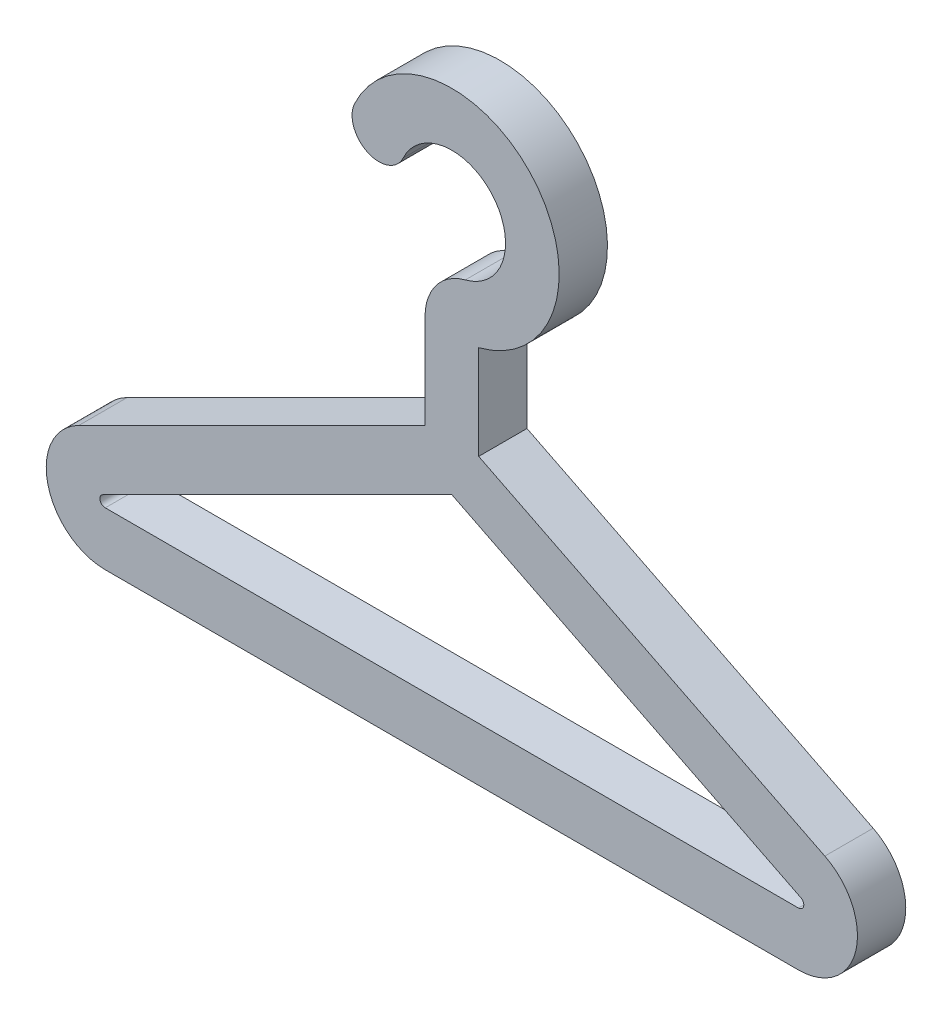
ISO-10303-21;
HEADER;
FILE_DESCRIPTION(('STEP AP214'),'2;1');
FILE_NAME('part.step','',(''),(''),'','','');
FILE_SCHEMA(('AUTOMOTIVE_DESIGN { 1 0 10303 214 1 1 1 1 }'));
ENDSEC;
DATA;
#1=APPLICATION_CONTEXT('core data for automotive mechanical design processes');
#2=APPLICATION_PROTOCOL_DEFINITION('international standard','automotive_design',2000,#1);
#3=PRODUCT_CONTEXT('',#1,'mechanical');
#4=PRODUCT('Part','Part','',(#3));
#5=PRODUCT_RELATED_PRODUCT_CATEGORY('part','',(#4));
#6=PRODUCT_DEFINITION_FORMATION('','',#4);
#7=PRODUCT_DEFINITION_CONTEXT('part definition',#1,'design');
#8=PRODUCT_DEFINITION('design','',#6,#7);
#9=PRODUCT_DEFINITION_SHAPE('','',#8);
#10=(LENGTH_UNIT() NAMED_UNIT(*) SI_UNIT(.MILLI.,.METRE.));
#11=(NAMED_UNIT(*) PLANE_ANGLE_UNIT() SI_UNIT($,.RADIAN.));
#12=(NAMED_UNIT(*) SI_UNIT($,.STERADIAN.) SOLID_ANGLE_UNIT());
#13=UNCERTAINTY_MEASURE_WITH_UNIT(LENGTH_MEASURE(1.E-05),#10,'distance_accuracy_value','');
#14=(GEOMETRIC_REPRESENTATION_CONTEXT(3) GLOBAL_UNCERTAINTY_ASSIGNED_CONTEXT((#13)) GLOBAL_UNIT_ASSIGNED_CONTEXT((#10,
#11,#12)) REPRESENTATION_CONTEXT('',''));
#15=CARTESIAN_POINT('',(0.,0.,0.));
#16=DIRECTION('',(0.,0.,1.));
#17=DIRECTION('',(1.,0.,0.));
#18=AXIS2_PLACEMENT_3D('',#15,#16,#17);
#19=CARTESIAN_POINT('',(329.177708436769,-76.8932928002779,-25.5));
#20=DIRECTION('',(0.,0.,-1.));
#21=DIRECTION('',(-1.,0.,0.));
#22=AXIS2_PLACEMENT_3D('',#19,#20,#21);
#23=CYLINDRICAL_SURFACE('',#22,1.00000000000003);
#24=CARTESIAN_POINT('',(329.177708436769,-76.8932928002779,-34.5));
#25=DIRECTION('',(0.,0.,1.));
#26=DIRECTION('',(1.,0.,0.));
#27=AXIS2_PLACEMENT_3D('',#24,#25,#26);
#28=CIRCLE('',#27,1.00000000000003);
#29=CARTESIAN_POINT('',(329.177708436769,-77.8932928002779,-34.5));
#30=VERTEX_POINT('',#29);
#31=CARTESIAN_POINT('',(329.624922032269,-75.9988656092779,-34.5));
#32=VERTEX_POINT('',#31);
#33=EDGE_CURVE('E212',#30,#32,#28,.T.);
#34=ORIENTED_EDGE('',*,*,#33,.F.);
#35=DIRECTION('',(0.,0.,-1.));
#36=VECTOR('',#35,1.);
#37=CARTESIAN_POINT('',(329.177708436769,-77.8932928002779,-25.5));
#38=LINE('',#37,#36);
#39=CARTESIAN_POINT('',(329.177708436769,-77.8932928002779,-25.5));
#40=VERTEX_POINT('',#39);
#41=EDGE_CURVE('E11',#40,#30,#38,.T.);
#42=ORIENTED_EDGE('',*,*,#41,.F.);
#43=CARTESIAN_POINT('',(329.177708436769,-76.8932928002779,-25.5));
#44=DIRECTION('',(0.,0.,1.));
#45=DIRECTION('',(1.,0.,0.));
#46=AXIS2_PLACEMENT_3D('',#43,#44,#45);
#47=CIRCLE('',#46,1.00000000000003);
#48=CARTESIAN_POINT('',(329.624922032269,-75.9988656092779,-25.5));
#49=VERTEX_POINT('',#48);
#50=EDGE_CURVE('E324',#40,#49,#47,.T.);
#51=ORIENTED_EDGE('',*,*,#50,.T.);
#52=DIRECTION('',(0.,0.,-1.));
#53=VECTOR('',#52,1.);
#54=CARTESIAN_POINT('',(329.624922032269,-75.9988656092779,-25.5));
#55=LINE('',#54,#53);
#56=EDGE_CURVE('E55',#49,#32,#55,.T.);
#57=ORIENTED_EDGE('',*,*,#56,.T.);
#58=EDGE_LOOP('',(#34,#42,#51,#57));
#59=FACE_BOUND('',#58,.T.);
#60=ADVANCED_FACE('F36',(#59),#23,.F.);
#61=CARTESIAN_POINT('',(0.,-77.8932928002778,-25.5));
#62=DIRECTION('',(0.,1.,0.));
#63=DIRECTION('',(-1.,0.,0.));
#64=AXIS2_PLACEMENT_3D('',#61,#62,#63);
#65=PLANE('',#64);
#66=DIRECTION('',(1.,0.,0.));
#67=VECTOR('',#66,1.);
#68=CARTESIAN_POINT('',(0.,-77.8932928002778,-34.5));
#69=LINE('',#68,#67);
#70=CARTESIAN_POINT('',(200.010524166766,-77.8932928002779,-34.5));
#71=VERTEX_POINT('',#70);
#72=EDGE_CURVE('E214',#71,#30,#69,.T.);
#73=ORIENTED_EDGE('',*,*,#72,.F.);
#74=DIRECTION('',(0.,0.,-1.));
#75=VECTOR('',#74,1.);
#76=CARTESIAN_POINT('',(200.010524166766,-77.8932928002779,-25.5));
#77=LINE('',#76,#75);
#78=CARTESIAN_POINT('',(200.010524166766,-77.8932928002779,-25.5));
#79=VERTEX_POINT('',#78);
#80=EDGE_CURVE('E46',#79,#71,#77,.T.);
#81=ORIENTED_EDGE('',*,*,#80,.F.);
#82=DIRECTION('',(1.,0.,0.));
#83=VECTOR('',#82,1.);
#84=CARTESIAN_POINT('',(0.,-77.8932928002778,-25.5));
#85=LINE('',#84,#83);
#86=EDGE_CURVE('E175',#79,#40,#85,.T.);
#87=ORIENTED_EDGE('',*,*,#86,.T.);
#88=ORIENTED_EDGE('',*,*,#41,.T.);
#89=EDGE_LOOP('',(#73,#81,#87,#88));
#90=FACE_BOUND('',#89,.T.);
#91=ADVANCED_FACE('F327',(#90),#65,.T.);
#92=CARTESIAN_POINT('',(200.010524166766,-76.8932928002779,-25.5));
#93=DIRECTION('',(0.,0.,-1.));
#94=DIRECTION('',(-1.,0.,0.));
#95=AXIS2_PLACEMENT_3D('',#92,#93,#94);
#96=CYLINDRICAL_SURFACE('',#95,0.999999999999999);
#97=CARTESIAN_POINT('',(200.010524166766,-76.8932928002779,-34.5));
#98=DIRECTION('',(0.,0.,1.));
#99=DIRECTION('',(1.,0.,0.));
#100=AXIS2_PLACEMENT_3D('',#97,#98,#99);
#101=CIRCLE('',#100,0.999999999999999);
#102=CARTESIAN_POINT('',(199.563310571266,-75.9988656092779,-34.5));
#103=VERTEX_POINT('',#102);
#104=EDGE_CURVE('E162',#103,#71,#101,.T.);
#105=ORIENTED_EDGE('',*,*,#104,.F.);
#106=DIRECTION('',(0.,0.,-1.));
#107=VECTOR('',#106,1.);
#108=CARTESIAN_POINT('',(199.563310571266,-75.9988656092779,-25.5));
#109=LINE('',#108,#107);
#110=CARTESIAN_POINT('',(199.563310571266,-75.9988656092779,-25.5));
#111=VERTEX_POINT('',#110);
#112=EDGE_CURVE('E157',#111,#103,#109,.T.);
#113=ORIENTED_EDGE('',*,*,#112,.F.);
#114=CARTESIAN_POINT('',(200.010524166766,-76.8932928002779,-25.5));
#115=DIRECTION('',(0.,0.,1.));
#116=DIRECTION('',(1.,0.,0.));
#117=AXIS2_PLACEMENT_3D('',#114,#115,#116);
#118=CIRCLE('',#117,0.999999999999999);
#119=EDGE_CURVE('E160',#111,#79,#118,.T.);
#120=ORIENTED_EDGE('',*,*,#119,.T.);
#121=ORIENTED_EDGE('',*,*,#80,.T.);
#122=EDGE_LOOP('',(#105,#113,#120,#121));
#123=FACE_BOUND('',#122,.T.);
#124=ADVANCED_FACE('F159',(#123),#96,.F.);
#125=CARTESIAN_POINT('',(70.3122083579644,-140.624416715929,-25.5));
#126=DIRECTION('',(0.447213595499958,-0.894427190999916,0.));
#127=DIRECTION('',(0.894427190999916,0.447213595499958,0.));
#128=AXIS2_PLACEMENT_3D('',#125,#126,#127);
#129=PLANE('',#128);
#130=DIRECTION('',(-0.894427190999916,-0.447213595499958,0.));
#131=VECTOR('',#130,1.);
#132=CARTESIAN_POINT('',(70.3122083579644,-140.624416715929,-34.5));
#133=LINE('',#132,#131);
#134=CARTESIAN_POINT('',(264.594116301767,-43.4834627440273,-34.5));
#135=VERTEX_POINT('',#134);
#136=EDGE_CURVE('E218',#135,#103,#133,.T.);
#137=ORIENTED_EDGE('',*,*,#136,.F.);
#138=DIRECTION('',(0.,0.,-1.));
#139=VECTOR('',#138,1.);
#140=CARTESIAN_POINT('',(264.594116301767,-43.4834627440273,-25.5));
#141=LINE('',#140,#139);
#142=CARTESIAN_POINT('',(264.594116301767,-43.4834627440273,-25.5));
#143=VERTEX_POINT('',#142);
#144=EDGE_CURVE('E104',#143,#135,#141,.T.);
#145=ORIENTED_EDGE('',*,*,#144,.F.);
#146=DIRECTION('',(-0.894427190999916,-0.447213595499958,0.));
#147=VECTOR('',#146,1.);
#148=CARTESIAN_POINT('',(70.3122083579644,-140.624416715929,-25.5));
#149=LINE('',#148,#147);
#150=EDGE_CURVE('E173',#143,#111,#149,.T.);
#151=ORIENTED_EDGE('',*,*,#150,.T.);
#152=ORIENTED_EDGE('',*,*,#112,.T.);
#153=EDGE_LOOP('',(#137,#145,#151,#152));
#154=FACE_BOUND('',#153,.T.);
#155=ADVANCED_FACE('F177',(#154),#129,.T.);
#156=CARTESIAN_POINT('',(259.594116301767,0.,-25.5));
#157=DIRECTION('',(1.,0.,0.));
#158=DIRECTION('',(0.,0.,-1.));
#159=AXIS2_PLACEMENT_3D('',#156,#157,#158);
#160=PLANE('',#159);
#161=DIRECTION('',(0.,-1.,0.));
#162=VECTOR('',#161,1.);
#163=CARTESIAN_POINT('',(259.594116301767,0.,-34.5));
#164=LINE('',#163,#162);
#165=CARTESIAN_POINT('',(259.594116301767,-17.258209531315,-34.5));
#166=VERTEX_POINT('',#165);
#167=CARTESIAN_POINT('',(259.594116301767,-34.8031228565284,-34.5));
#168=VERTEX_POINT('',#167);
#169=EDGE_CURVE('E184',#166,#168,#164,.T.);
#170=ORIENTED_EDGE('',*,*,#169,.T.);
#171=DIRECTION('',(0.,0.,-1.));
#172=VECTOR('',#171,1.);
#173=CARTESIAN_POINT('',(259.594116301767,-34.8031228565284,-25.5));
#174=LINE('',#173,#172);
#175=CARTESIAN_POINT('',(259.594116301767,-34.8031228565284,-25.5));
#176=VERTEX_POINT('',#175);
#177=EDGE_CURVE('E40',#176,#168,#174,.T.);
#178=ORIENTED_EDGE('',*,*,#177,.F.);
#179=DIRECTION('',(0.,-1.,0.));
#180=VECTOR('',#179,1.);
#181=CARTESIAN_POINT('',(259.594116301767,0.,-25.5));
#182=LINE('',#181,#180);
#183=CARTESIAN_POINT('',(259.594116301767,-17.258209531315,-25.5));
#184=VERTEX_POINT('',#183);
#185=EDGE_CURVE('E223',#184,#176,#182,.T.);
#186=ORIENTED_EDGE('',*,*,#185,.F.);
#187=DIRECTION('',(0.,0.,-1.));
#188=VECTOR('',#187,1.);
#189=CARTESIAN_POINT('',(259.594116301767,-17.258209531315,-25.5));
#190=LINE('',#189,#188);
#191=EDGE_CURVE('E180',#184,#166,#190,.T.);
#192=ORIENTED_EDGE('',*,*,#191,.T.);
#193=EDGE_LOOP('',(#170,#178,#186,#192));
#194=FACE_BOUND('',#193,.T.);
#195=ADVANCED_FACE('F38',(#194),#160,.F.);
#196=CARTESIAN_POINT('',(65.8400724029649,-131.68014480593,-25.5));
#197=DIRECTION('',(0.447213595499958,-0.894427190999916,0.));
#198=DIRECTION('',(0.894427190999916,0.447213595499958,0.));
#199=AXIS2_PLACEMENT_3D('',#196,#197,#198);
#200=PLANE('',#199);
#201=DIRECTION('',(-0.894427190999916,-0.447213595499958,0.));
#202=VECTOR('',#201,1.);
#203=CARTESIAN_POINT('',(65.8400724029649,-131.68014480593,-34.5));
#204=LINE('',#203,#202);
#205=CARTESIAN_POINT('',(195.091174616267,-67.0545936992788,-34.5));
#206=VERTEX_POINT('',#205);
#207=EDGE_CURVE('E187',#168,#206,#204,.T.);
#208=ORIENTED_EDGE('',*,*,#207,.T.);
#209=DIRECTION('',(0.,0.,-1.));
#210=VECTOR('',#209,1.);
#211=CARTESIAN_POINT('',(195.091174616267,-67.0545936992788,-25.5));
#212=LINE('',#211,#210);
#213=CARTESIAN_POINT('',(195.091174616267,-67.0545936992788,-25.5));
#214=VERTEX_POINT('',#213);
#215=EDGE_CURVE('E247',#214,#206,#212,.T.);
#216=ORIENTED_EDGE('',*,*,#215,.F.);
#217=DIRECTION('',(-0.894427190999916,-0.447213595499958,0.));
#218=VECTOR('',#217,1.);
#219=CARTESIAN_POINT('',(65.8400724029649,-131.68014480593,-25.5));
#220=LINE('',#219,#218);
#221=EDGE_CURVE('E117',#176,#214,#220,.T.);
#222=ORIENTED_EDGE('',*,*,#221,.F.);
#223=ORIENTED_EDGE('',*,*,#177,.T.);
#224=EDGE_LOOP('',(#208,#216,#222,#223));
#225=FACE_BOUND('',#224,.T.);
#226=ADVANCED_FACE('F253',(#225),#200,.F.);
#227=CARTESIAN_POINT('',(200.010524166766,-76.8932928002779,-25.5));
#228=DIRECTION('',(0.,0.,-1.));
#229=DIRECTION('',(-1.,0.,0.));
#230=AXIS2_PLACEMENT_3D('',#227,#228,#229);
#231=CYLINDRICAL_SURFACE('',#230,11.);
#232=CARTESIAN_POINT('',(200.010524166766,-76.8932928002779,-34.5));
#233=DIRECTION('',(0.,0.,1.));
#234=DIRECTION('',(1.,0.,0.));
#235=AXIS2_PLACEMENT_3D('',#232,#233,#234);
#236=CIRCLE('',#235,11.);
#237=CARTESIAN_POINT('',(200.010524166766,-87.8932928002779,-34.5));
#238=VERTEX_POINT('',#237);
#239=EDGE_CURVE('E189',#206,#238,#236,.T.);
#240=ORIENTED_EDGE('',*,*,#239,.T.);
#241=DIRECTION('',(0.,0.,-1.));
#242=VECTOR('',#241,1.);
#243=CARTESIAN_POINT('',(200.010524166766,-87.8932928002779,-25.5));
#244=LINE('',#243,#242);
#245=CARTESIAN_POINT('',(200.010524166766,-87.8932928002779,-25.5));
#246=VERTEX_POINT('',#245);
#247=EDGE_CURVE('E245',#246,#238,#244,.T.);
#248=ORIENTED_EDGE('',*,*,#247,.F.);
#249=CARTESIAN_POINT('',(200.010524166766,-76.8932928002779,-25.5));
#250=DIRECTION('',(0.,0.,1.));
#251=DIRECTION('',(1.,0.,0.));
#252=AXIS2_PLACEMENT_3D('',#249,#250,#251);
#253=CIRCLE('',#252,11.);
#254=EDGE_CURVE('E309',#214,#246,#253,.T.);
#255=ORIENTED_EDGE('',*,*,#254,.F.);
#256=ORIENTED_EDGE('',*,*,#215,.T.);
#257=EDGE_LOOP('',(#240,#248,#255,#256));
#258=FACE_BOUND('',#257,.T.);
#259=ADVANCED_FACE('F308',(#258),#231,.T.);
#260=CARTESIAN_POINT('',(0.,-87.8932928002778,-25.5));
#261=DIRECTION('',(0.,1.,0.));
#262=DIRECTION('',(-1.,0.,0.));
#263=AXIS2_PLACEMENT_3D('',#260,#261,#262);
#264=PLANE('',#263);
#265=DIRECTION('',(1.,0.,0.));
#266=VECTOR('',#265,1.);
#267=CARTESIAN_POINT('',(0.,-87.8932928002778,-34.5));
#268=LINE('',#267,#266);
#269=CARTESIAN_POINT('',(329.177708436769,-87.8932928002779,-34.5));
#270=VERTEX_POINT('',#269);
#271=EDGE_CURVE('E191',#238,#270,#268,.T.);
#272=ORIENTED_EDGE('',*,*,#271,.T.);
#273=DIRECTION('',(0.,0.,-1.));
#274=VECTOR('',#273,1.);
#275=CARTESIAN_POINT('',(329.177708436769,-87.8932928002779,-25.5));
#276=LINE('',#275,#274);
#277=CARTESIAN_POINT('',(329.177708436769,-87.8932928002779,-25.5));
#278=VERTEX_POINT('',#277);
#279=EDGE_CURVE('E242',#278,#270,#276,.T.);
#280=ORIENTED_EDGE('',*,*,#279,.F.);
#281=DIRECTION('',(1.,0.,0.));
#282=VECTOR('',#281,1.);
#283=CARTESIAN_POINT('',(0.,-87.8932928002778,-25.5));
#284=LINE('',#283,#282);
#285=EDGE_CURVE('E306',#246,#278,#284,.T.);
#286=ORIENTED_EDGE('',*,*,#285,.F.);
#287=ORIENTED_EDGE('',*,*,#247,.T.);
#288=EDGE_LOOP('',(#272,#280,#286,#287));
#289=FACE_BOUND('',#288,.T.);
#290=ADVANCED_FACE('F305',(#289),#264,.F.);
#291=CARTESIAN_POINT('',(329.177708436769,-76.8932928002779,-25.5));
#292=DIRECTION('',(0.,0.,-1.));
#293=DIRECTION('',(-1.,0.,0.));
#294=AXIS2_PLACEMENT_3D('',#291,#292,#293);
#295=CYLINDRICAL_SURFACE('',#294,11.);
#296=CARTESIAN_POINT('',(329.177708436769,-76.8932928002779,-34.5));
#297=DIRECTION('',(0.,0.,1.));
#298=DIRECTION('',(1.,0.,0.));
#299=AXIS2_PLACEMENT_3D('',#296,#297,#298);
#300=CIRCLE('',#299,11.);
#301=CARTESIAN_POINT('',(334.097057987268,-67.0545936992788,-34.5));
#302=VERTEX_POINT('',#301);
#303=EDGE_CURVE('E193',#270,#302,#300,.T.);
#304=ORIENTED_EDGE('',*,*,#303,.T.);
#305=DIRECTION('',(0.,0.,-1.));
#306=VECTOR('',#305,1.);
#307=CARTESIAN_POINT('',(334.097057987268,-67.0545936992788,-25.5));
#308=LINE('',#307,#306);
#309=CARTESIAN_POINT('',(334.097057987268,-67.0545936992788,-25.5));
#310=VERTEX_POINT('',#309);
#311=EDGE_CURVE('E239',#310,#302,#308,.T.);
#312=ORIENTED_EDGE('',*,*,#311,.F.);
#313=CARTESIAN_POINT('',(329.177708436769,-76.8932928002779,-25.5));
#314=DIRECTION('',(0.,0.,1.));
#315=DIRECTION('',(1.,0.,0.));
#316=AXIS2_PLACEMENT_3D('',#313,#314,#315);
#317=CIRCLE('',#316,11.);
#318=EDGE_CURVE('E301',#278,#310,#317,.T.);
#319=ORIENTED_EDGE('',*,*,#318,.F.);
#320=ORIENTED_EDGE('',*,*,#279,.T.);
#321=EDGE_LOOP('',(#304,#312,#319,#320));
#322=FACE_BOUND('',#321,.T.);
#323=ADVANCED_FACE('F300',(#322),#295,.T.);
#324=CARTESIAN_POINT('',(39.9975741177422,79.9951482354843,-25.5));
#325=DIRECTION('',(-0.447213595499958,-0.894427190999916,0.));
#326=DIRECTION('',(0.894427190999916,-0.447213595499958,0.));
#327=AXIS2_PLACEMENT_3D('',#324,#325,#326);
#328=PLANE('',#327);
#329=DIRECTION('',(-0.894427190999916,0.447213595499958,0.));
#330=VECTOR('',#329,1.);
#331=CARTESIAN_POINT('',(39.9975741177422,79.9951482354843,-34.5));
#332=LINE('',#331,#330);
#333=CARTESIAN_POINT('',(269.594116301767,-34.8031228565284,-34.5));
#334=VERTEX_POINT('',#333);
#335=EDGE_CURVE('E195',#302,#334,#332,.T.);
#336=ORIENTED_EDGE('',*,*,#335,.T.);
#337=DIRECTION('',(0.,0.,-1.));
#338=VECTOR('',#337,1.);
#339=CARTESIAN_POINT('',(269.594116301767,-34.8031228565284,-25.5));
#340=LINE('',#339,#338);
#341=CARTESIAN_POINT('',(269.594116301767,-34.8031228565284,-25.5));
#342=VERTEX_POINT('',#341);
#343=EDGE_CURVE('E237',#342,#334,#340,.T.);
#344=ORIENTED_EDGE('',*,*,#343,.F.);
#345=DIRECTION('',(-0.894427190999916,0.447213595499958,0.));
#346=VECTOR('',#345,1.);
#347=CARTESIAN_POINT('',(39.9975741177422,79.9951482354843,-25.5));
#348=LINE('',#347,#346);
#349=EDGE_CURVE('E297',#310,#342,#348,.T.);
#350=ORIENTED_EDGE('',*,*,#349,.F.);
#351=ORIENTED_EDGE('',*,*,#311,.T.);
#352=EDGE_LOOP('',(#336,#344,#350,#351));
#353=FACE_BOUND('',#352,.T.);
#354=ADVANCED_FACE('F294',(#353),#328,.F.);
#355=CARTESIAN_POINT('',(269.594116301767,0.,-25.5));
#356=DIRECTION('',(1.,0.,0.));
#357=DIRECTION('',(0.,0.,-1.));
#358=AXIS2_PLACEMENT_3D('',#355,#356,#357);
#359=PLANE('',#358);
#360=DIRECTION('',(0.,-1.,0.));
#361=VECTOR('',#360,1.);
#362=CARTESIAN_POINT('',(269.594116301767,0.,-34.5));
#363=LINE('',#362,#361);
#364=CARTESIAN_POINT('',(269.594116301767,-17.258209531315,-34.5));
#365=VERTEX_POINT('',#364);
#366=EDGE_CURVE('E198',#365,#334,#363,.T.);
#367=ORIENTED_EDGE('',*,*,#366,.F.);
#368=DIRECTION('',(0.,0.,-1.));
#369=VECTOR('',#368,1.);
#370=CARTESIAN_POINT('',(269.594116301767,-17.258209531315,-25.5));
#371=LINE('',#370,#369);
#372=CARTESIAN_POINT('',(269.594116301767,-17.258209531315,-25.5));
#373=VERTEX_POINT('',#372);
#374=EDGE_CURVE('E235',#373,#365,#371,.T.);
#375=ORIENTED_EDGE('',*,*,#374,.F.);
#376=DIRECTION('',(0.,-1.,0.));
#377=VECTOR('',#376,1.);
#378=CARTESIAN_POINT('',(269.594116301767,0.,-25.5));
#379=LINE('',#378,#377);
#380=EDGE_CURVE('E288',#373,#342,#379,.T.);
#381=ORIENTED_EDGE('',*,*,#380,.T.);
#382=ORIENTED_EDGE('',*,*,#343,.T.);
#383=EDGE_LOOP('',(#367,#375,#381,#382));
#384=FACE_BOUND('',#383,.T.);
#385=ADVANCED_FACE('F287',(#384),#359,.T.);
#386=CARTESIAN_POINT('',(264.594116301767,2.10670719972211,-25.5));
#387=DIRECTION('',(0.,0.,-1.));
#388=DIRECTION('',(-1.,0.,0.));
#389=AXIS2_PLACEMENT_3D('',#386,#387,#388);
#390=CYLINDRICAL_SURFACE('',#389,20.);
#391=CARTESIAN_POINT('',(264.594116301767,2.10670719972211,-34.5));
#392=DIRECTION('',(0.,0.,1.));
#393=DIRECTION('',(1.,0.,0.));
#394=AXIS2_PLACEMENT_3D('',#391,#392,#393);
#395=CIRCLE('',#394,20.);
#396=CARTESIAN_POINT('',(246.467960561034,10.5590724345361,-34.5));
#397=VERTEX_POINT('',#396);
#398=EDGE_CURVE('E201',#365,#397,#395,.T.);
#399=ORIENTED_EDGE('',*,*,#398,.T.);
#400=DIRECTION('',(0.,0.,-1.));
#401=VECTOR('',#400,1.);
#402=CARTESIAN_POINT('',(246.467960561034,10.5590724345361,-25.5));
#403=LINE('',#402,#401);
#404=CARTESIAN_POINT('',(246.467960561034,10.5590724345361,-25.5));
#405=VERTEX_POINT('',#404);
#406=EDGE_CURVE('E232',#405,#397,#403,.T.);
#407=ORIENTED_EDGE('',*,*,#406,.F.);
#408=CARTESIAN_POINT('',(264.594116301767,2.10670719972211,-25.5));
#409=DIRECTION('',(0.,0.,1.));
#410=DIRECTION('',(1.,0.,0.));
#411=AXIS2_PLACEMENT_3D('',#408,#409,#410);
#412=CIRCLE('',#411,20.);
#413=EDGE_CURVE('E283',#373,#405,#412,.T.);
#414=ORIENTED_EDGE('',*,*,#413,.F.);
#415=ORIENTED_EDGE('',*,*,#374,.T.);
#416=EDGE_LOOP('',(#399,#407,#414,#415));
#417=FACE_BOUND('',#416,.T.);
#418=ADVANCED_FACE('F282',(#417),#390,.T.);
#419=CARTESIAN_POINT('',(250.999499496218,8.44598112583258,-25.5));
#420=DIRECTION('',(0.,0.,-1.));
#421=DIRECTION('',(-1.,0.,0.));
#422=AXIS2_PLACEMENT_3D('',#419,#420,#421);
#423=CYLINDRICAL_SURFACE('',#422,5.);
#424=CARTESIAN_POINT('',(250.999499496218,8.44598112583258,-34.5));
#425=DIRECTION('',(0.,0.,1.));
#426=DIRECTION('',(1.,0.,0.));
#427=AXIS2_PLACEMENT_3D('',#424,#425,#426);
#428=CIRCLE('',#427,5.);
#429=CARTESIAN_POINT('',(255.531038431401,6.33288981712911,-34.5));
#430=VERTEX_POINT('',#429);
#431=EDGE_CURVE('E203',#397,#430,#428,.T.);
#432=ORIENTED_EDGE('',*,*,#431,.T.);
#433=DIRECTION('',(0.,0.,-1.));
#434=VECTOR('',#433,1.);
#435=CARTESIAN_POINT('',(255.531038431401,6.33288981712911,-25.5));
#436=LINE('',#435,#434);
#437=CARTESIAN_POINT('',(255.531038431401,6.33288981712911,-25.5));
#438=VERTEX_POINT('',#437);
#439=EDGE_CURVE('E230',#438,#430,#436,.T.);
#440=ORIENTED_EDGE('',*,*,#439,.F.);
#441=CARTESIAN_POINT('',(250.999499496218,8.44598112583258,-25.5));
#442=DIRECTION('',(0.,0.,1.));
#443=DIRECTION('',(1.,0.,0.));
#444=AXIS2_PLACEMENT_3D('',#441,#442,#443);
#445=CIRCLE('',#444,5.);
#446=EDGE_CURVE('E279',#405,#438,#445,.T.);
#447=ORIENTED_EDGE('',*,*,#446,.F.);
#448=ORIENTED_EDGE('',*,*,#406,.T.);
#449=EDGE_LOOP('',(#432,#440,#447,#448));
#450=FACE_BOUND('',#449,.T.);
#451=ADVANCED_FACE('F276',(#450),#423,.T.);
#452=CARTESIAN_POINT('',(264.594116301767,2.10670719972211,-25.5));
#453=DIRECTION('',(0.,0.,-1.));
#454=DIRECTION('',(-1.,0.,0.));
#455=AXIS2_PLACEMENT_3D('',#452,#453,#454);
#456=CYLINDRICAL_SURFACE('',#455,9.99999999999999);
#457=CARTESIAN_POINT('',(264.594116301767,2.10670719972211,-34.5));
#458=DIRECTION('',(0.,0.,1.));
#459=DIRECTION('',(1.,0.,0.));
#460=AXIS2_PLACEMENT_3D('',#457,#458,#459);
#461=CIRCLE('',#460,9.99999999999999);
#462=CARTESIAN_POINT('',(267.094116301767,-7.57575116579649,-34.5));
#463=VERTEX_POINT('',#462);
#464=EDGE_CURVE('E206',#463,#430,#461,.T.);
#465=ORIENTED_EDGE('',*,*,#464,.F.);
#466=DIRECTION('',(0.,0.,-1.));
#467=VECTOR('',#466,1.);
#468=CARTESIAN_POINT('',(267.094116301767,-7.57575116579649,-25.5));
#469=LINE('',#468,#467);
#470=CARTESIAN_POINT('',(267.094116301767,-7.57575116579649,-25.5));
#471=VERTEX_POINT('',#470);
#472=EDGE_CURVE('E228',#471,#463,#469,.T.);
#473=ORIENTED_EDGE('',*,*,#472,.F.);
#474=CARTESIAN_POINT('',(264.594116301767,2.10670719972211,-25.5));
#475=DIRECTION('',(0.,0.,1.));
#476=DIRECTION('',(1.,0.,0.));
#477=AXIS2_PLACEMENT_3D('',#474,#475,#476);
#478=CIRCLE('',#477,9.99999999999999);
#479=EDGE_CURVE('E321',#471,#438,#478,.T.);
#480=ORIENTED_EDGE('',*,*,#479,.T.);
#481=ORIENTED_EDGE('',*,*,#439,.T.);
#482=EDGE_LOOP('',(#465,#473,#480,#481));
#483=FACE_BOUND('',#482,.T.);
#484=ADVANCED_FACE('F270',(#483),#456,.F.);
#485=CARTESIAN_POINT('',(269.594116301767,-17.258209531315,-25.5));
#486=DIRECTION('',(0.,0.,-1.));
#487=DIRECTION('',(-1.,0.,0.));
#488=AXIS2_PLACEMENT_3D('',#485,#486,#487);
#489=CYLINDRICAL_SURFACE('',#488,9.99999999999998);
#490=CARTESIAN_POINT('',(269.594116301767,-17.258209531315,-34.5));
#491=DIRECTION('',(0.,0.,1.));
#492=DIRECTION('',(1.,0.,0.));
#493=AXIS2_PLACEMENT_3D('',#490,#491,#492);
#494=CIRCLE('',#493,9.99999999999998);
#495=EDGE_CURVE('E209',#166,#463,#494,.F.);
#496=ORIENTED_EDGE('',*,*,#495,.F.);
#497=ORIENTED_EDGE('',*,*,#191,.F.);
#498=CARTESIAN_POINT('',(269.594116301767,-17.258209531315,-25.5));
#499=DIRECTION('',(0.,0.,1.));
#500=DIRECTION('',(1.,0.,0.));
#501=AXIS2_PLACEMENT_3D('',#498,#499,#500);
#502=CIRCLE('',#501,9.99999999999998);
#503=EDGE_CURVE('E266',#184,#471,#502,.F.);
#504=ORIENTED_EDGE('',*,*,#503,.T.);
#505=ORIENTED_EDGE('',*,*,#472,.T.);
#506=EDGE_LOOP('',(#496,#497,#504,#505));
#507=FACE_BOUND('',#506,.T.);
#508=ADVANCED_FACE('F262',(#507),#489,.T.);
#509=CARTESIAN_POINT('',(35.5254381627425,71.050876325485,-25.5));
#510=DIRECTION('',(-0.447213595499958,-0.894427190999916,0.));
#511=DIRECTION('',(0.894427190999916,-0.447213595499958,0.));
#512=AXIS2_PLACEMENT_3D('',#509,#510,#511);
#513=PLANE('',#512);
#514=DIRECTION('',(-0.894427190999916,0.447213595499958,0.));
#515=VECTOR('',#514,1.);
#516=CARTESIAN_POINT('',(35.5254381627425,71.050876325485,-34.5));
#517=LINE('',#516,#515);
#518=EDGE_CURVE('E220',#32,#135,#517,.T.);
#519=ORIENTED_EDGE('',*,*,#518,.F.);
#520=ORIENTED_EDGE('',*,*,#56,.F.);
#521=DIRECTION('',(-0.894427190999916,0.447213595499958,0.));
#522=VECTOR('',#521,1.);
#523=CARTESIAN_POINT('',(35.5254381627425,71.050876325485,-25.5));
#524=LINE('',#523,#522);
#525=EDGE_CURVE('E178',#49,#143,#524,.T.);
#526=ORIENTED_EDGE('',*,*,#525,.T.);
#527=ORIENTED_EDGE('',*,*,#144,.T.);
#528=EDGE_LOOP('',(#519,#520,#526,#527));
#529=FACE_BOUND('',#528,.T.);
#530=ADVANCED_FACE('F328',(#529),#513,.T.);
#531=CARTESIAN_POINT('',(0.,0.,-25.5));
#532=DIRECTION('',(0.,0.,1.));
#533=DIRECTION('',(1.,0.,0.));
#534=AXIS2_PLACEMENT_3D('',#531,#532,#533);
#535=PLANE('',#534);
#536=ORIENTED_EDGE('',*,*,#185,.T.);
#537=ORIENTED_EDGE('',*,*,#221,.T.);
#538=ORIENTED_EDGE('',*,*,#254,.T.);
#539=ORIENTED_EDGE('',*,*,#285,.T.);
#540=ORIENTED_EDGE('',*,*,#318,.T.);
#541=ORIENTED_EDGE('',*,*,#349,.T.);
#542=ORIENTED_EDGE('',*,*,#380,.F.);
#543=ORIENTED_EDGE('',*,*,#413,.T.);
#544=ORIENTED_EDGE('',*,*,#446,.T.);
#545=ORIENTED_EDGE('',*,*,#479,.F.);
#546=ORIENTED_EDGE('',*,*,#503,.F.);
#547=EDGE_LOOP('',(#536,#537,#538,#539,#540,#541,#542,#543,#544,#545,#546));
#548=FACE_BOUND('',#547,.T.);
#549=ORIENTED_EDGE('',*,*,#50,.F.);
#550=ORIENTED_EDGE('',*,*,#86,.F.);
#551=ORIENTED_EDGE('',*,*,#119,.F.);
#552=ORIENTED_EDGE('',*,*,#150,.F.);
#553=ORIENTED_EDGE('',*,*,#525,.F.);
#554=EDGE_LOOP('',(#549,#550,#551,#552,#553));
#555=FACE_BOUND('',#554,.T.);
#556=ADVANCED_FACE('F171',(#548,#555),#535,.T.);
#557=CARTESIAN_POINT('',(0.,0.,-34.5));
#558=DIRECTION('',(0.,0.,1.));
#559=DIRECTION('',(1.,0.,0.));
#560=AXIS2_PLACEMENT_3D('',#557,#558,#559);
#561=PLANE('',#560);
#562=ORIENTED_EDGE('',*,*,#169,.F.);
#563=ORIENTED_EDGE('',*,*,#495,.T.);
#564=ORIENTED_EDGE('',*,*,#464,.T.);
#565=ORIENTED_EDGE('',*,*,#431,.F.);
#566=ORIENTED_EDGE('',*,*,#398,.F.);
#567=ORIENTED_EDGE('',*,*,#366,.T.);
#568=ORIENTED_EDGE('',*,*,#335,.F.);
#569=ORIENTED_EDGE('',*,*,#303,.F.);
#570=ORIENTED_EDGE('',*,*,#271,.F.);
#571=ORIENTED_EDGE('',*,*,#239,.F.);
#572=ORIENTED_EDGE('',*,*,#207,.F.);
#573=EDGE_LOOP('',(#562,#563,#564,#565,#566,#567,#568,#569,#570,#571,#572));
#574=FACE_BOUND('',#573,.T.);
#575=ORIENTED_EDGE('',*,*,#33,.T.);
#576=ORIENTED_EDGE('',*,*,#518,.T.);
#577=ORIENTED_EDGE('',*,*,#136,.T.);
#578=ORIENTED_EDGE('',*,*,#104,.T.);
#579=ORIENTED_EDGE('',*,*,#72,.T.);
#580=EDGE_LOOP('',(#575,#576,#577,#578,#579));
#581=FACE_BOUND('',#580,.T.);
#582=ADVANCED_FACE('F259',(#574,#581),#561,.F.);
#583=CLOSED_SHELL('',(#60,#91,#124,#155,#195,#226,#259,#290,#323,#354,#385,#418,#451,#484,#508,
#530,#556,#582));
#584=MANIFOLD_SOLID_BREP('B2',#583);
#585=ADVANCED_BREP_SHAPE_REPRESENTATION('',(#18,#584),#14);
#586=SHAPE_DEFINITION_REPRESENTATION(#9,#585);
ENDSEC;
END-ISO-10303-21;
